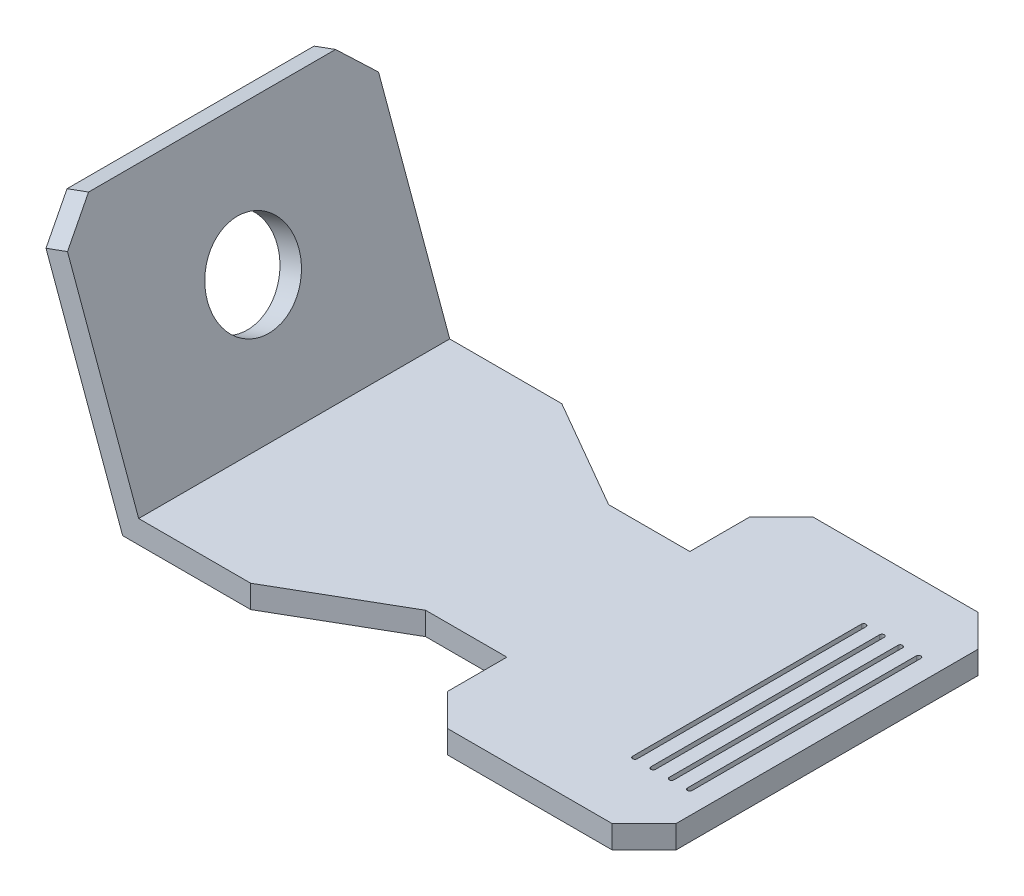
ISO-10303-21;
HEADER;
FILE_DESCRIPTION(('STEP AP214'),'2;1');
FILE_NAME('part.step','',(''),(''),'','','');
FILE_SCHEMA(('AUTOMOTIVE_DESIGN { 1 0 10303 214 1 1 1 1 }'));
ENDSEC;
DATA;
#1=APPLICATION_CONTEXT('core data for automotive mechanical design processes');
#2=APPLICATION_PROTOCOL_DEFINITION('international standard','automotive_design',2000,#1);
#3=PRODUCT_CONTEXT('',#1,'mechanical');
#4=PRODUCT('Part','Part','',(#3));
#5=PRODUCT_RELATED_PRODUCT_CATEGORY('part','',(#4));
#6=PRODUCT_DEFINITION_FORMATION('','',#4);
#7=PRODUCT_DEFINITION_CONTEXT('part definition',#1,'design');
#8=PRODUCT_DEFINITION('design','',#6,#7);
#9=PRODUCT_DEFINITION_SHAPE('','',#8);
#10=(LENGTH_UNIT() NAMED_UNIT(*) SI_UNIT(.MILLI.,.METRE.));
#11=(NAMED_UNIT(*) PLANE_ANGLE_UNIT() SI_UNIT($,.RADIAN.));
#12=(NAMED_UNIT(*) SI_UNIT($,.STERADIAN.) SOLID_ANGLE_UNIT());
#13=UNCERTAINTY_MEASURE_WITH_UNIT(LENGTH_MEASURE(1.E-05),#10,'distance_accuracy_value','');
#14=(GEOMETRIC_REPRESENTATION_CONTEXT(3) GLOBAL_UNCERTAINTY_ASSIGNED_CONTEXT((#13)) GLOBAL_UNIT_ASSIGNED_CONTEXT((#10,
#11,#12)) REPRESENTATION_CONTEXT('',''));
#15=CARTESIAN_POINT('',(0.,0.,0.));
#16=DIRECTION('',(0.,0.,1.));
#17=DIRECTION('',(1.,0.,0.));
#18=AXIS2_PLACEMENT_3D('',#15,#16,#17);
#19=CARTESIAN_POINT('',(-50.,5.,40.));
#20=DIRECTION('',(0.,-1.,0.));
#21=DIRECTION('',(0.,0.,-1.));
#22=AXIS2_PLACEMENT_3D('',#19,#20,#21);
#23=PLANE('',#22);
#24=DIRECTION('',(0.,0.,-1.));
#25=VECTOR('',#24,1.);
#26=CARTESIAN_POINT('',(-8.5,5.,25.));
#27=LINE('',#26,#25);
#28=CARTESIAN_POINT('',(-8.5,5.,25.));
#29=VERTEX_POINT('',#28);
#30=CARTESIAN_POINT('',(-8.5,5.,-25.));
#31=VERTEX_POINT('',#30);
#32=EDGE_CURVE('E280',#29,#31,#27,.T.);
#33=ORIENTED_EDGE('',*,*,#32,.F.);
#34=CARTESIAN_POINT('',(-9.,5.,25.));
#35=DIRECTION('',(0.,1.,0.));
#36=DIRECTION('',(0.,0.,1.));
#37=AXIS2_PLACEMENT_3D('',#34,#35,#36);
#38=CIRCLE('',#37,0.5);
#39=CARTESIAN_POINT('',(-9.5,5.,25.));
#40=VERTEX_POINT('',#39);
#41=EDGE_CURVE('E316',#40,#29,#38,.T.);
#42=ORIENTED_EDGE('',*,*,#41,.F.);
#43=DIRECTION('',(0.,0.,1.));
#44=VECTOR('',#43,1.);
#45=CARTESIAN_POINT('',(-9.5,5.,25.));
#46=LINE('',#45,#44);
#47=CARTESIAN_POINT('',(-9.5,5.,-25.));
#48=VERTEX_POINT('',#47);
#49=EDGE_CURVE('E302',#48,#40,#46,.T.);
#50=ORIENTED_EDGE('',*,*,#49,.F.);
#51=CARTESIAN_POINT('',(-9.,5.,-25.));
#52=DIRECTION('',(0.,1.,0.));
#53=DIRECTION('',(0.,0.,1.));
#54=AXIS2_PLACEMENT_3D('',#51,#52,#53);
#55=CIRCLE('',#54,0.5);
#56=EDGE_CURVE('E295',#31,#48,#55,.T.);
#57=ORIENTED_EDGE('',*,*,#56,.F.);
#58=EDGE_LOOP('',(#33,#42,#50,#57));
#59=FACE_BOUND('',#58,.T.);
#60=DIRECTION('',(0.,0.,-1.));
#61=VECTOR('',#60,1.);
#62=CARTESIAN_POINT('',(-4.5,5.,25.));
#63=LINE('',#62,#61);
#64=CARTESIAN_POINT('',(-4.5,5.,25.));
#65=VERTEX_POINT('',#64);
#66=CARTESIAN_POINT('',(-4.5,5.,-25.));
#67=VERTEX_POINT('',#66);
#68=EDGE_CURVE('E337',#65,#67,#63,.T.);
#69=ORIENTED_EDGE('',*,*,#68,.F.);
#70=CARTESIAN_POINT('',(-5.,5.,25.));
#71=DIRECTION('',(0.,1.,0.));
#72=DIRECTION('',(0.,0.,1.));
#73=AXIS2_PLACEMENT_3D('',#70,#71,#72);
#74=CIRCLE('',#73,0.5);
#75=CARTESIAN_POINT('',(-5.5,5.,25.));
#76=VERTEX_POINT('',#75);
#77=EDGE_CURVE('E321',#76,#65,#74,.T.);
#78=ORIENTED_EDGE('',*,*,#77,.F.);
#79=DIRECTION('',(0.,0.,1.));
#80=VECTOR('',#79,1.);
#81=CARTESIAN_POINT('',(-5.5,5.,25.));
#82=LINE('',#81,#80);
#83=CARTESIAN_POINT('',(-5.5,5.,-25.));
#84=VERTEX_POINT('',#83);
#85=EDGE_CURVE('E326',#84,#76,#82,.T.);
#86=ORIENTED_EDGE('',*,*,#85,.F.);
#87=CARTESIAN_POINT('',(-5.,5.,-25.));
#88=DIRECTION('',(0.,1.,0.));
#89=DIRECTION('',(0.,0.,1.));
#90=AXIS2_PLACEMENT_3D('',#87,#88,#89);
#91=CIRCLE('',#90,0.5);
#92=EDGE_CURVE('E340',#67,#84,#91,.T.);
#93=ORIENTED_EDGE('',*,*,#92,.F.);
#94=EDGE_LOOP('',(#69,#78,#86,#93));
#95=FACE_BOUND('',#94,.T.);
#96=DIRECTION('',(0.,0.,-1.));
#97=VECTOR('',#96,1.);
#98=CARTESIAN_POINT('',(0.,5.,40.));
#99=LINE('',#98,#97);
#100=CARTESIAN_POINT('',(0.,5.,33.));
#101=VERTEX_POINT('',#100);
#102=CARTESIAN_POINT('',(0.,5.,-33.));
#103=VERTEX_POINT('',#102);
#104=EDGE_CURVE('E370',#101,#103,#99,.T.);
#105=ORIENTED_EDGE('',*,*,#104,.T.);
#106=DIRECTION('',(0.707106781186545,0.,0.70710678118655));
#107=VECTOR('',#106,1.);
#108=CARTESIAN_POINT('',(-6.99999999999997,5.,-40.));
#109=LINE('',#108,#107);
#110=CARTESIAN_POINT('',(-6.99999999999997,5.,-40.));
#111=VERTEX_POINT('',#110);
#112=EDGE_CURVE('E544',#103,#111,#109,.F.);
#113=ORIENTED_EDGE('',*,*,#112,.T.);
#114=DIRECTION('',(-1.,0.,0.));
#115=VECTOR('',#114,1.);
#116=CARTESIAN_POINT('',(0.,5.,-40.));
#117=LINE('',#116,#115);
#118=CARTESIAN_POINT('',(-43.,5.,-40.));
#119=VERTEX_POINT('',#118);
#120=EDGE_CURVE('E374',#111,#119,#117,.T.);
#121=ORIENTED_EDGE('',*,*,#120,.T.);
#122=DIRECTION('',(0.707106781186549,0.,-0.707106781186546));
#123=VECTOR('',#122,1.);
#124=CARTESIAN_POINT('',(-50.,5.,-33.));
#125=LINE('',#124,#123);
#126=CARTESIAN_POINT('',(-50.,5.,-33.));
#127=VERTEX_POINT('',#126);
#128=EDGE_CURVE('E540',#119,#127,#125,.F.);
#129=ORIENTED_EDGE('',*,*,#128,.T.);
#130=DIRECTION('',(0.,0.,1.));
#131=VECTOR('',#130,1.);
#132=CARTESIAN_POINT('',(-50.,5.,-40.));
#133=LINE('',#132,#131);
#134=CARTESIAN_POINT('',(-50.,5.,-20.));
#135=VERTEX_POINT('',#134);
#136=EDGE_CURVE('E377',#127,#135,#133,.T.);
#137=ORIENTED_EDGE('',*,*,#136,.T.);
#138=DIRECTION('',(-1.,0.,0.));
#139=VECTOR('',#138,1.);
#140=CARTESIAN_POINT('',(-50.,5.,-20.));
#141=LINE('',#140,#139);
#142=CARTESIAN_POINT('',(-67.7512886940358,5.,-20.));
#143=VERTEX_POINT('',#142);
#144=EDGE_CURVE('E379',#135,#143,#141,.T.);
#145=ORIENTED_EDGE('',*,*,#144,.T.);
#146=DIRECTION('',(-0.866025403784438,0.,-0.500000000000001));
#147=VECTOR('',#146,1.);
#148=CARTESIAN_POINT('',(-67.7512886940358,5.,-20.));
#149=LINE('',#148,#147);
#150=CARTESIAN_POINT('',(-92.,5.,-34.));
#151=VERTEX_POINT('',#150);
#152=EDGE_CURVE('E382',#143,#151,#149,.T.);
#153=ORIENTED_EDGE('',*,*,#152,.T.);
#154=DIRECTION('',(-1.,0.,0.));
#155=VECTOR('',#154,1.);
#156=CARTESIAN_POINT('',(-92.,5.,-34.));
#157=LINE('',#156,#155);
#158=CARTESIAN_POINT('',(-116.498962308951,5.,-34.));
#159=VERTEX_POINT('',#158);
#160=EDGE_CURVE('E384',#151,#159,#157,.T.);
#161=ORIENTED_EDGE('',*,*,#160,.T.);
#162=DIRECTION('',(0.,0.,-1.));
#163=VECTOR('',#162,1.);
#164=CARTESIAN_POINT('',(-116.498962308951,5.,40.));
#165=LINE('',#164,#163);
#166=CARTESIAN_POINT('',(-116.498962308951,5.,34.));
#167=VERTEX_POINT('',#166);
#168=EDGE_CURVE('E451',#167,#159,#165,.T.);
#169=ORIENTED_EDGE('',*,*,#168,.F.);
#170=DIRECTION('',(1.,0.,0.));
#171=VECTOR('',#170,1.);
#172=CARTESIAN_POINT('',(-92.,5.,34.));
#173=LINE('',#172,#171);
#174=CARTESIAN_POINT('',(-92.,5.,34.));
#175=VERTEX_POINT('',#174);
#176=EDGE_CURVE('E387',#167,#175,#173,.T.);
#177=ORIENTED_EDGE('',*,*,#176,.T.);
#178=DIRECTION('',(0.866025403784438,0.,-0.500000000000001));
#179=VECTOR('',#178,1.);
#180=CARTESIAN_POINT('',(-67.7512886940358,5.,20.));
#181=LINE('',#180,#179);
#182=CARTESIAN_POINT('',(-67.7512886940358,5.,20.));
#183=VERTEX_POINT('',#182);
#184=EDGE_CURVE('E389',#175,#183,#181,.T.);
#185=ORIENTED_EDGE('',*,*,#184,.T.);
#186=DIRECTION('',(1.,0.,0.));
#187=VECTOR('',#186,1.);
#188=CARTESIAN_POINT('',(-50.,5.,20.));
#189=LINE('',#188,#187);
#190=CARTESIAN_POINT('',(-50.,5.,20.));
#191=VERTEX_POINT('',#190);
#192=EDGE_CURVE('E391',#183,#191,#189,.T.);
#193=ORIENTED_EDGE('',*,*,#192,.T.);
#194=DIRECTION('',(0.,0.,1.));
#195=VECTOR('',#194,1.);
#196=CARTESIAN_POINT('',(-50.,5.,40.));
#197=LINE('',#196,#195);
#198=CARTESIAN_POINT('',(-50.,5.,33.));
#199=VERTEX_POINT('',#198);
#200=EDGE_CURVE('E394',#191,#199,#197,.T.);
#201=ORIENTED_EDGE('',*,*,#200,.T.);
#202=DIRECTION('',(-0.707106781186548,0.,-0.707106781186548));
#203=VECTOR('',#202,1.);
#204=CARTESIAN_POINT('',(-43.,5.,40.));
#205=LINE('',#204,#203);
#206=CARTESIAN_POINT('',(-43.,5.,40.));
#207=VERTEX_POINT('',#206);
#208=EDGE_CURVE('E538',#199,#207,#205,.F.);
#209=ORIENTED_EDGE('',*,*,#208,.T.);
#210=DIRECTION('',(1.,0.,0.));
#211=VECTOR('',#210,1.);
#212=CARTESIAN_POINT('',(0.,5.,40.));
#213=LINE('',#212,#211);
#214=CARTESIAN_POINT('',(-7.00000000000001,5.,40.));
#215=VERTEX_POINT('',#214);
#216=EDGE_CURVE('E367',#207,#215,#213,.T.);
#217=ORIENTED_EDGE('',*,*,#216,.T.);
#218=DIRECTION('',(-0.707106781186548,0.,0.707106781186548));
#219=VECTOR('',#218,1.);
#220=CARTESIAN_POINT('',(0.,5.,33.));
#221=LINE('',#220,#219);
#222=EDGE_CURVE('E542',#215,#101,#221,.F.);
#223=ORIENTED_EDGE('',*,*,#222,.T.);
#224=EDGE_LOOP('',(#105,#113,#121,#129,#137,#145,#153,#161,#169,#177,#185,#193,#201,#209,#217,#223));
#225=FACE_BOUND('',#224,.T.);
#226=CARTESIAN_POINT('',(-13.,5.,25.));
#227=DIRECTION('',(0.,1.,0.));
#228=DIRECTION('',(0.,0.,1.));
#229=AXIS2_PLACEMENT_3D('',#226,#227,#228);
#230=CIRCLE('',#229,0.5);
#231=CARTESIAN_POINT('',(-13.5,5.,25.));
#232=VERTEX_POINT('',#231);
#233=CARTESIAN_POINT('',(-12.5,5.,25.));
#234=VERTEX_POINT('',#233);
#235=EDGE_CURVE('E454',#232,#234,#230,.T.);
#236=ORIENTED_EDGE('',*,*,#235,.F.);
#237=DIRECTION('',(0.,0.,1.));
#238=VECTOR('',#237,1.);
#239=CARTESIAN_POINT('',(-13.5,5.,25.));
#240=LINE('',#239,#238);
#241=CARTESIAN_POINT('',(-13.5,5.,-25.));
#242=VERTEX_POINT('',#241);
#243=EDGE_CURVE('E456',#242,#232,#240,.T.);
#244=ORIENTED_EDGE('',*,*,#243,.F.);
#245=CARTESIAN_POINT('',(-13.,5.,-25.));
#246=DIRECTION('',(0.,1.,0.));
#247=DIRECTION('',(0.,0.,1.));
#248=AXIS2_PLACEMENT_3D('',#245,#246,#247);
#249=CIRCLE('',#248,0.5);
#250=CARTESIAN_POINT('',(-12.5,5.,-25.));
#251=VERTEX_POINT('',#250);
#252=EDGE_CURVE('E459',#251,#242,#249,.T.);
#253=ORIENTED_EDGE('',*,*,#252,.F.);
#254=DIRECTION('',(0.,0.,-1.));
#255=VECTOR('',#254,1.);
#256=CARTESIAN_POINT('',(-12.5,5.,25.));
#257=LINE('',#256,#255);
#258=EDGE_CURVE('E462',#234,#251,#257,.T.);
#259=ORIENTED_EDGE('',*,*,#258,.F.);
#260=EDGE_LOOP('',(#236,#244,#253,#259));
#261=FACE_BOUND('',#260,.T.);
#262=CARTESIAN_POINT('',(-17.,5.,25.));
#263=DIRECTION('',(0.,1.,0.));
#264=DIRECTION('',(0.,0.,1.));
#265=AXIS2_PLACEMENT_3D('',#262,#263,#264);
#266=CIRCLE('',#265,0.5);
#267=CARTESIAN_POINT('',(-17.5,5.,25.));
#268=VERTEX_POINT('',#267);
#269=CARTESIAN_POINT('',(-16.5,5.,25.));
#270=VERTEX_POINT('',#269);
#271=EDGE_CURVE('E486',#268,#270,#266,.T.);
#272=ORIENTED_EDGE('',*,*,#271,.F.);
#273=DIRECTION('',(0.,0.,1.));
#274=VECTOR('',#273,1.);
#275=CARTESIAN_POINT('',(-17.5,5.,25.));
#276=LINE('',#275,#274);
#277=CARTESIAN_POINT('',(-17.5,5.,-25.));
#278=VERTEX_POINT('',#277);
#279=EDGE_CURVE('E488',#278,#268,#276,.T.);
#280=ORIENTED_EDGE('',*,*,#279,.F.);
#281=CARTESIAN_POINT('',(-17.,5.,-25.));
#282=DIRECTION('',(0.,1.,0.));
#283=DIRECTION('',(0.,0.,1.));
#284=AXIS2_PLACEMENT_3D('',#281,#282,#283);
#285=CIRCLE('',#284,0.5);
#286=CARTESIAN_POINT('',(-16.5,5.,-25.));
#287=VERTEX_POINT('',#286);
#288=EDGE_CURVE('E492',#287,#278,#285,.T.);
#289=ORIENTED_EDGE('',*,*,#288,.F.);
#290=DIRECTION('',(0.,0.,-1.));
#291=VECTOR('',#290,1.);
#292=CARTESIAN_POINT('',(-16.5,5.,25.));
#293=LINE('',#292,#291);
#294=EDGE_CURVE('E495',#270,#287,#293,.T.);
#295=ORIENTED_EDGE('',*,*,#294,.F.);
#296=EDGE_LOOP('',(#272,#280,#289,#295));
#297=FACE_BOUND('',#296,.T.);
#298=ADVANCED_FACE('F40',(#59,#95,#225,#261,#297),#23,.F.);
#299=CARTESIAN_POINT('',(0.,5.,40.));
#300=DIRECTION('',(0.,0.,-1.));
#301=DIRECTION('',(-1.,0.,0.));
#302=AXIS2_PLACEMENT_3D('',#299,#300,#301);
#303=PLANE('',#302);
#304=DIRECTION('',(1.,0.,0.));
#305=VECTOR('',#304,1.);
#306=CARTESIAN_POINT('',(0.,0.,40.));
#307=LINE('',#306,#305);
#308=CARTESIAN_POINT('',(-43.,0.,40.));
#309=VERTEX_POINT('',#308);
#310=CARTESIAN_POINT('',(-7.00000000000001,0.,40.));
#311=VERTEX_POINT('',#310);
#312=EDGE_CURVE('E361',#309,#311,#307,.T.);
#313=ORIENTED_EDGE('',*,*,#312,.T.);
#314=DIRECTION('',(0.,1.,0.));
#315=VECTOR('',#314,1.);
#316=CARTESIAN_POINT('',(-7.00000000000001,5.,40.));
#317=LINE('',#316,#315);
#318=EDGE_CURVE('E549',#311,#215,#317,.T.);
#319=ORIENTED_EDGE('',*,*,#318,.T.);
#320=ORIENTED_EDGE('',*,*,#216,.F.);
#321=DIRECTION('',(0.,-1.,0.));
#322=VECTOR('',#321,1.);
#323=CARTESIAN_POINT('',(-43.,5.,40.));
#324=LINE('',#323,#322);
#325=EDGE_CURVE('E546',#207,#309,#324,.T.);
#326=ORIENTED_EDGE('',*,*,#325,.T.);
#327=EDGE_LOOP('',(#313,#319,#320,#326));
#328=FACE_BOUND('',#327,.T.);
#329=ADVANCED_FACE('F625',(#328),#303,.F.);
#330=CARTESIAN_POINT('',(0.,5.,40.));
#331=DIRECTION('',(-1.,0.,0.));
#332=DIRECTION('',(0.,0.,1.));
#333=AXIS2_PLACEMENT_3D('',#330,#331,#332);
#334=PLANE('',#333);
#335=DIRECTION('',(0.,0.,-1.));
#336=VECTOR('',#335,1.);
#337=CARTESIAN_POINT('',(0.,0.,40.));
#338=LINE('',#337,#336);
#339=CARTESIAN_POINT('',(0.,0.,33.));
#340=VERTEX_POINT('',#339);
#341=CARTESIAN_POINT('',(0.,0.,-33.));
#342=VERTEX_POINT('',#341);
#343=EDGE_CURVE('E401',#340,#342,#338,.T.);
#344=ORIENTED_EDGE('',*,*,#343,.T.);
#345=DIRECTION('',(0.,1.,0.));
#346=VECTOR('',#345,1.);
#347=CARTESIAN_POINT('',(0.,5.,-33.));
#348=LINE('',#347,#346);
#349=EDGE_CURVE('E536',#342,#103,#348,.T.);
#350=ORIENTED_EDGE('',*,*,#349,.T.);
#351=ORIENTED_EDGE('',*,*,#104,.F.);
#352=DIRECTION('',(0.,-1.,0.));
#353=VECTOR('',#352,1.);
#354=CARTESIAN_POINT('',(0.,5.,33.));
#355=LINE('',#354,#353);
#356=EDGE_CURVE('E533',#101,#340,#355,.T.);
#357=ORIENTED_EDGE('',*,*,#356,.T.);
#358=EDGE_LOOP('',(#344,#350,#351,#357));
#359=FACE_BOUND('',#358,.T.);
#360=ADVANCED_FACE('F634',(#359),#334,.F.);
#361=CARTESIAN_POINT('',(0.,5.,-40.));
#362=DIRECTION('',(0.,0.,1.));
#363=DIRECTION('',(1.,0.,0.));
#364=AXIS2_PLACEMENT_3D('',#361,#362,#363);
#365=PLANE('',#364);
#366=ORIENTED_EDGE('',*,*,#120,.F.);
#367=DIRECTION('',(0.,-1.,0.));
#368=VECTOR('',#367,1.);
#369=CARTESIAN_POINT('',(-6.99999999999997,5.,-40.));
#370=LINE('',#369,#368);
#371=CARTESIAN_POINT('',(-6.99999999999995,0.,-40.));
#372=VERTEX_POINT('',#371);
#373=EDGE_CURVE('E522',#111,#372,#370,.T.);
#374=ORIENTED_EDGE('',*,*,#373,.T.);
#375=DIRECTION('',(-1.,0.,0.));
#376=VECTOR('',#375,1.);
#377=CARTESIAN_POINT('',(0.,0.,-40.));
#378=LINE('',#377,#376);
#379=CARTESIAN_POINT('',(-43.,0.,-40.));
#380=VERTEX_POINT('',#379);
#381=EDGE_CURVE('E404',#372,#380,#378,.T.);
#382=ORIENTED_EDGE('',*,*,#381,.T.);
#383=DIRECTION('',(0.,1.,0.));
#384=VECTOR('',#383,1.);
#385=CARTESIAN_POINT('',(-43.,5.,-40.));
#386=LINE('',#385,#384);
#387=EDGE_CURVE('E520',#380,#119,#386,.T.);
#388=ORIENTED_EDGE('',*,*,#387,.T.);
#389=EDGE_LOOP('',(#366,#374,#382,#388));
#390=FACE_BOUND('',#389,.T.);
#391=ADVANCED_FACE('F642',(#390),#365,.F.);
#392=CARTESIAN_POINT('',(-50.,5.,-40.));
#393=DIRECTION('',(1.,0.,0.));
#394=DIRECTION('',(0.,0.,-1.));
#395=AXIS2_PLACEMENT_3D('',#392,#393,#394);
#396=PLANE('',#395);
#397=ORIENTED_EDGE('',*,*,#136,.F.);
#398=DIRECTION('',(0.,-1.,0.));
#399=VECTOR('',#398,1.);
#400=CARTESIAN_POINT('',(-50.,5.,-33.));
#401=LINE('',#400,#399);
#402=CARTESIAN_POINT('',(-50.,0.,-33.));
#403=VERTEX_POINT('',#402);
#404=EDGE_CURVE('E551',#127,#403,#401,.T.);
#405=ORIENTED_EDGE('',*,*,#404,.T.);
#406=DIRECTION('',(0.,0.,1.));
#407=VECTOR('',#406,1.);
#408=CARTESIAN_POINT('',(-50.,0.,-40.));
#409=LINE('',#408,#407);
#410=CARTESIAN_POINT('',(-50.,0.,-20.));
#411=VERTEX_POINT('',#410);
#412=EDGE_CURVE('E407',#403,#411,#409,.T.);
#413=ORIENTED_EDGE('',*,*,#412,.T.);
#414=DIRECTION('',(0.,-1.,0.));
#415=VECTOR('',#414,1.);
#416=CARTESIAN_POINT('',(-50.,5.,-20.));
#417=LINE('',#416,#415);
#418=EDGE_CURVE('E447',#135,#411,#417,.T.);
#419=ORIENTED_EDGE('',*,*,#418,.F.);
#420=EDGE_LOOP('',(#397,#405,#413,#419));
#421=FACE_BOUND('',#420,.T.);
#422=ADVANCED_FACE('F651',(#421),#396,.F.);
#423=CARTESIAN_POINT('',(-50.,5.,-20.));
#424=DIRECTION('',(0.,0.,1.));
#425=DIRECTION('',(1.,0.,0.));
#426=AXIS2_PLACEMENT_3D('',#423,#424,#425);
#427=PLANE('',#426);
#428=DIRECTION('',(-1.,0.,0.));
#429=VECTOR('',#428,1.);
#430=CARTESIAN_POINT('',(-50.,0.,-20.));
#431=LINE('',#430,#429);
#432=CARTESIAN_POINT('',(-67.7512886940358,0.,-20.));
#433=VERTEX_POINT('',#432);
#434=EDGE_CURVE('E410',#411,#433,#431,.T.);
#435=ORIENTED_EDGE('',*,*,#434,.T.);
#436=DIRECTION('',(0.,-1.,0.));
#437=VECTOR('',#436,1.);
#438=CARTESIAN_POINT('',(-67.7512886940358,5.,-20.));
#439=LINE('',#438,#437);
#440=EDGE_CURVE('E443',#143,#433,#439,.T.);
#441=ORIENTED_EDGE('',*,*,#440,.F.);
#442=ORIENTED_EDGE('',*,*,#144,.F.);
#443=ORIENTED_EDGE('',*,*,#418,.T.);
#444=EDGE_LOOP('',(#435,#441,#442,#443));
#445=FACE_BOUND('',#444,.T.);
#446=ADVANCED_FACE('F656',(#445),#427,.F.);
#447=CARTESIAN_POINT('',(-67.7512886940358,5.,-20.));
#448=DIRECTION('',(-0.500000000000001,0.,0.866025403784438));
#449=DIRECTION('',(0.866025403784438,0.,0.500000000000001));
#450=AXIS2_PLACEMENT_3D('',#447,#448,#449);
#451=PLANE('',#450);
#452=DIRECTION('',(-0.866025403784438,0.,-0.500000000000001));
#453=VECTOR('',#452,1.);
#454=CARTESIAN_POINT('',(-67.7512886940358,0.,-20.));
#455=LINE('',#454,#453);
#456=CARTESIAN_POINT('',(-92.,0.,-34.));
#457=VERTEX_POINT('',#456);
#458=EDGE_CURVE('E413',#433,#457,#455,.T.);
#459=ORIENTED_EDGE('',*,*,#458,.T.);
#460=DIRECTION('',(0.,-1.,0.));
#461=VECTOR('',#460,1.);
#462=CARTESIAN_POINT('',(-92.,5.,-34.));
#463=LINE('',#462,#461);
#464=EDGE_CURVE('E440',#151,#457,#463,.T.);
#465=ORIENTED_EDGE('',*,*,#464,.F.);
#466=ORIENTED_EDGE('',*,*,#152,.F.);
#467=ORIENTED_EDGE('',*,*,#440,.T.);
#468=EDGE_LOOP('',(#459,#465,#466,#467));
#469=FACE_BOUND('',#468,.T.);
#470=ADVANCED_FACE('F657',(#469),#451,.F.);
#471=CARTESIAN_POINT('',(-92.,5.,-34.));
#472=DIRECTION('',(0.,0.,1.));
#473=DIRECTION('',(1.,0.,0.));
#474=AXIS2_PLACEMENT_3D('',#471,#472,#473);
#475=PLANE('',#474);
#476=DIRECTION('',(-0.342020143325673,0.939692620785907,0.));
#477=VECTOR('',#476,1.);
#478=CARTESIAN_POINT('',(-120.,0.,-34.));
#479=LINE('',#478,#477);
#480=CARTESIAN_POINT('',(-120.,0.,-34.));
#481=VERTEX_POINT('',#480);
#482=CARTESIAN_POINT('',(-136.758987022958,46.0449384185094,-34.));
#483=VERTEX_POINT('',#482);
#484=EDGE_CURVE('E347',#481,#483,#479,.T.);
#485=ORIENTED_EDGE('',*,*,#484,.T.);
#486=DIRECTION('',(0.939692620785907,0.342020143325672,0.));
#487=VECTOR('',#486,1.);
#488=CARTESIAN_POINT('',(-110.427395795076,55.6288538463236,-34.));
#489=LINE('',#488,#487);
#490=CARTESIAN_POINT('',(-132.060523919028,47.7550391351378,-34.));
#491=VERTEX_POINT('',#490);
#492=EDGE_CURVE('E556',#483,#491,#489,.T.);
#493=ORIENTED_EDGE('',*,*,#492,.T.);
#494=DIRECTION('',(0.342020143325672,-0.939692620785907,0.));
#495=VECTOR('',#494,1.);
#496=CARTESIAN_POINT('',(-115.30153689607,1.71010071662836,-34.));
#497=LINE('',#496,#495);
#498=EDGE_CURVE('E356',#491,#159,#497,.T.);
#499=ORIENTED_EDGE('',*,*,#498,.T.);
#500=ORIENTED_EDGE('',*,*,#160,.F.);
#501=ORIENTED_EDGE('',*,*,#464,.T.);
#502=DIRECTION('',(-1.,0.,0.));
#503=VECTOR('',#502,1.);
#504=CARTESIAN_POINT('',(-92.,0.,-34.));
#505=LINE('',#504,#503);
#506=EDGE_CURVE('E416',#457,#481,#505,.T.);
#507=ORIENTED_EDGE('',*,*,#506,.T.);
#508=EDGE_LOOP('',(#485,#493,#499,#500,#501,#507));
#509=FACE_BOUND('',#508,.T.);
#510=ADVANCED_FACE('F575',(#509),#475,.F.);
#511=CARTESIAN_POINT('',(-92.,5.,34.));
#512=DIRECTION('',(0.,0.,-1.));
#513=DIRECTION('',(-1.,0.,0.));
#514=AXIS2_PLACEMENT_3D('',#511,#512,#513);
#515=PLANE('',#514);
#516=DIRECTION('',(0.342020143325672,-0.939692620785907,0.));
#517=VECTOR('',#516,1.);
#518=CARTESIAN_POINT('',(-115.30153689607,1.71010071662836,34.));
#519=LINE('',#518,#517);
#520=CARTESIAN_POINT('',(-132.060523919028,47.7550391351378,34.));
#521=VERTEX_POINT('',#520);
#522=EDGE_CURVE('E359',#521,#167,#519,.T.);
#523=ORIENTED_EDGE('',*,*,#522,.F.);
#524=DIRECTION('',(-0.939692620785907,-0.342020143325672,0.));
#525=VECTOR('',#524,1.);
#526=CARTESIAN_POINT('',(-110.427395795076,55.6288538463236,34.));
#527=LINE('',#526,#525);
#528=CARTESIAN_POINT('',(-136.758987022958,46.0449384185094,34.));
#529=VERTEX_POINT('',#528);
#530=EDGE_CURVE('E11',#521,#529,#527,.T.);
#531=ORIENTED_EDGE('',*,*,#530,.T.);
#532=DIRECTION('',(-0.342020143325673,0.939692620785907,0.));
#533=VECTOR('',#532,1.);
#534=CARTESIAN_POINT('',(-120.,0.,34.));
#535=LINE('',#534,#533);
#536=CARTESIAN_POINT('',(-120.,0.,34.));
#537=VERTEX_POINT('',#536);
#538=EDGE_CURVE('E362',#537,#529,#535,.T.);
#539=ORIENTED_EDGE('',*,*,#538,.F.);
#540=DIRECTION('',(1.,0.,0.));
#541=VECTOR('',#540,1.);
#542=CARTESIAN_POINT('',(-92.,0.,34.));
#543=LINE('',#542,#541);
#544=CARTESIAN_POINT('',(-92.,0.,34.));
#545=VERTEX_POINT('',#544);
#546=EDGE_CURVE('E421',#537,#545,#543,.T.);
#547=ORIENTED_EDGE('',*,*,#546,.T.);
#548=DIRECTION('',(0.,-1.,0.));
#549=VECTOR('',#548,1.);
#550=CARTESIAN_POINT('',(-92.,5.,34.));
#551=LINE('',#550,#549);
#552=EDGE_CURVE('E437',#175,#545,#551,.T.);
#553=ORIENTED_EDGE('',*,*,#552,.F.);
#554=ORIENTED_EDGE('',*,*,#176,.F.);
#555=EDGE_LOOP('',(#523,#531,#539,#547,#553,#554));
#556=FACE_BOUND('',#555,.T.);
#557=ADVANCED_FACE('F589',(#556),#515,.F.);
#558=CARTESIAN_POINT('',(-67.7512886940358,5.,20.));
#559=DIRECTION('',(-0.500000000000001,0.,-0.866025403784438));
#560=DIRECTION('',(-0.866025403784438,0.,0.500000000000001));
#561=AXIS2_PLACEMENT_3D('',#558,#559,#560);
#562=PLANE('',#561);
#563=DIRECTION('',(0.866025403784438,0.,-0.500000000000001));
#564=VECTOR('',#563,1.);
#565=CARTESIAN_POINT('',(-67.7512886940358,0.,20.));
#566=LINE('',#565,#564);
#567=CARTESIAN_POINT('',(-67.7512886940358,0.,20.));
#568=VERTEX_POINT('',#567);
#569=EDGE_CURVE('E423',#545,#568,#566,.T.);
#570=ORIENTED_EDGE('',*,*,#569,.T.);
#571=DIRECTION('',(0.,-1.,0.));
#572=VECTOR('',#571,1.);
#573=CARTESIAN_POINT('',(-67.7512886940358,5.,20.));
#574=LINE('',#573,#572);
#575=EDGE_CURVE('E434',#183,#568,#574,.T.);
#576=ORIENTED_EDGE('',*,*,#575,.F.);
#577=ORIENTED_EDGE('',*,*,#184,.F.);
#578=ORIENTED_EDGE('',*,*,#552,.T.);
#579=EDGE_LOOP('',(#570,#576,#577,#578));
#580=FACE_BOUND('',#579,.T.);
#581=ADVANCED_FACE('F607',(#580),#562,.F.);
#582=CARTESIAN_POINT('',(-50.,5.,20.));
#583=DIRECTION('',(0.,0.,-1.));
#584=DIRECTION('',(-1.,0.,0.));
#585=AXIS2_PLACEMENT_3D('',#582,#583,#584);
#586=PLANE('',#585);
#587=DIRECTION('',(1.,0.,0.));
#588=VECTOR('',#587,1.);
#589=CARTESIAN_POINT('',(-50.,0.,20.));
#590=LINE('',#589,#588);
#591=CARTESIAN_POINT('',(-50.,0.,20.));
#592=VERTEX_POINT('',#591);
#593=EDGE_CURVE('E425',#568,#592,#590,.T.);
#594=ORIENTED_EDGE('',*,*,#593,.T.);
#595=DIRECTION('',(0.,-1.,0.));
#596=VECTOR('',#595,1.);
#597=CARTESIAN_POINT('',(-50.,5.,20.));
#598=LINE('',#597,#596);
#599=EDGE_CURVE('E398',#191,#592,#598,.T.);
#600=ORIENTED_EDGE('',*,*,#599,.F.);
#601=ORIENTED_EDGE('',*,*,#192,.F.);
#602=ORIENTED_EDGE('',*,*,#575,.T.);
#603=EDGE_LOOP('',(#594,#600,#601,#602));
#604=FACE_BOUND('',#603,.T.);
#605=ADVANCED_FACE('F612',(#604),#586,.F.);
#606=CARTESIAN_POINT('',(-50.,5.,40.));
#607=DIRECTION('',(1.,0.,0.));
#608=DIRECTION('',(0.,0.,-1.));
#609=AXIS2_PLACEMENT_3D('',#606,#607,#608);
#610=PLANE('',#609);
#611=DIRECTION('',(0.,0.,1.));
#612=VECTOR('',#611,1.);
#613=CARTESIAN_POINT('',(-50.,0.,40.));
#614=LINE('',#613,#612);
#615=CARTESIAN_POINT('',(-50.,0.,33.));
#616=VERTEX_POINT('',#615);
#617=EDGE_CURVE('E371',#592,#616,#614,.T.);
#618=ORIENTED_EDGE('',*,*,#617,.T.);
#619=DIRECTION('',(0.,1.,0.));
#620=VECTOR('',#619,1.);
#621=CARTESIAN_POINT('',(-50.,5.,33.));
#622=LINE('',#621,#620);
#623=EDGE_CURVE('E554',#616,#199,#622,.T.);
#624=ORIENTED_EDGE('',*,*,#623,.T.);
#625=ORIENTED_EDGE('',*,*,#200,.F.);
#626=ORIENTED_EDGE('',*,*,#599,.T.);
#627=EDGE_LOOP('',(#618,#624,#625,#626));
#628=FACE_BOUND('',#627,.T.);
#629=ADVANCED_FACE('F616',(#628),#610,.F.);
#630=CARTESIAN_POINT('',(-50.,0.,40.));
#631=DIRECTION('',(0.,-1.,0.));
#632=DIRECTION('',(0.,0.,-1.));
#633=AXIS2_PLACEMENT_3D('',#630,#631,#632);
#634=PLANE('',#633);
#635=CARTESIAN_POINT('',(-9.,0.,25.));
#636=DIRECTION('',(0.,1.,0.));
#637=DIRECTION('',(0.,0.,1.));
#638=AXIS2_PLACEMENT_3D('',#635,#636,#637);
#639=CIRCLE('',#638,0.5);
#640=CARTESIAN_POINT('',(-9.5,0.,25.));
#641=VERTEX_POINT('',#640);
#642=CARTESIAN_POINT('',(-8.5,0.,25.));
#643=VERTEX_POINT('',#642);
#644=EDGE_CURVE('E318',#641,#643,#639,.T.);
#645=ORIENTED_EDGE('',*,*,#644,.T.);
#646=DIRECTION('',(0.,0.,-1.));
#647=VECTOR('',#646,1.);
#648=CARTESIAN_POINT('',(-8.5,0.,25.));
#649=LINE('',#648,#647);
#650=CARTESIAN_POINT('',(-8.5,0.,-25.));
#651=VERTEX_POINT('',#650);
#652=EDGE_CURVE('E290',#643,#651,#649,.T.);
#653=ORIENTED_EDGE('',*,*,#652,.T.);
#654=CARTESIAN_POINT('',(-9.,0.,-25.));
#655=DIRECTION('',(0.,1.,0.));
#656=DIRECTION('',(0.,0.,1.));
#657=AXIS2_PLACEMENT_3D('',#654,#655,#656);
#658=CIRCLE('',#657,0.5);
#659=CARTESIAN_POINT('',(-9.5,0.,-25.));
#660=VERTEX_POINT('',#659);
#661=EDGE_CURVE('E298',#651,#660,#658,.T.);
#662=ORIENTED_EDGE('',*,*,#661,.T.);
#663=DIRECTION('',(0.,0.,1.));
#664=VECTOR('',#663,1.);
#665=CARTESIAN_POINT('',(-9.5,0.,25.));
#666=LINE('',#665,#664);
#667=EDGE_CURVE('E313',#660,#641,#666,.T.);
#668=ORIENTED_EDGE('',*,*,#667,.T.);
#669=EDGE_LOOP('',(#645,#653,#662,#668));
#670=FACE_BOUND('',#669,.T.);
#671=CARTESIAN_POINT('',(-5.,0.,25.));
#672=DIRECTION('',(0.,1.,0.));
#673=DIRECTION('',(0.,0.,1.));
#674=AXIS2_PLACEMENT_3D('',#671,#672,#673);
#675=CIRCLE('',#674,0.5);
#676=CARTESIAN_POINT('',(-5.5,0.,25.));
#677=VERTEX_POINT('',#676);
#678=CARTESIAN_POINT('',(-4.5,0.,25.));
#679=VERTEX_POINT('',#678);
#680=EDGE_CURVE('E322',#677,#679,#675,.T.);
#681=ORIENTED_EDGE('',*,*,#680,.T.);
#682=DIRECTION('',(0.,0.,-1.));
#683=VECTOR('',#682,1.);
#684=CARTESIAN_POINT('',(-4.5,0.,25.));
#685=LINE('',#684,#683);
#686=CARTESIAN_POINT('',(-4.5,0.,-25.));
#687=VERTEX_POINT('',#686);
#688=EDGE_CURVE('E325',#679,#687,#685,.T.);
#689=ORIENTED_EDGE('',*,*,#688,.T.);
#690=CARTESIAN_POINT('',(-5.,0.,-25.));
#691=DIRECTION('',(0.,1.,0.));
#692=DIRECTION('',(0.,0.,1.));
#693=AXIS2_PLACEMENT_3D('',#690,#691,#692);
#694=CIRCLE('',#693,0.5);
#695=CARTESIAN_POINT('',(-5.5,0.,-25.));
#696=VERTEX_POINT('',#695);
#697=EDGE_CURVE('E329',#687,#696,#694,.T.);
#698=ORIENTED_EDGE('',*,*,#697,.T.);
#699=DIRECTION('',(0.,0.,1.));
#700=VECTOR('',#699,1.);
#701=CARTESIAN_POINT('',(-5.5,0.,25.));
#702=LINE('',#701,#700);
#703=EDGE_CURVE('E332',#696,#677,#702,.T.);
#704=ORIENTED_EDGE('',*,*,#703,.T.);
#705=EDGE_LOOP('',(#681,#689,#698,#704));
#706=FACE_BOUND('',#705,.T.);
#707=ORIENTED_EDGE('',*,*,#381,.F.);
#708=DIRECTION('',(-0.707106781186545,0.,-0.70710678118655));
#709=VECTOR('',#708,1.);
#710=CARTESIAN_POINT('',(11.5000000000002,0.,-21.4999999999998));
#711=LINE('',#710,#709);
#712=EDGE_CURVE('E531',#372,#342,#711,.F.);
#713=ORIENTED_EDGE('',*,*,#712,.T.);
#714=ORIENTED_EDGE('',*,*,#343,.F.);
#715=DIRECTION('',(0.707106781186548,0.,-0.707106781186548));
#716=VECTOR('',#715,1.);
#717=CARTESIAN_POINT('',(-28.5,0.,61.5));
#718=LINE('',#717,#716);
#719=EDGE_CURVE('E529',#340,#311,#718,.F.);
#720=ORIENTED_EDGE('',*,*,#719,.T.);
#721=ORIENTED_EDGE('',*,*,#312,.F.);
#722=DIRECTION('',(0.707106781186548,0.,0.707106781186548));
#723=VECTOR('',#722,1.);
#724=CARTESIAN_POINT('',(-46.5,0.,36.5));
#725=LINE('',#724,#723);
#726=EDGE_CURVE('E525',#309,#616,#725,.F.);
#727=ORIENTED_EDGE('',*,*,#726,.T.);
#728=ORIENTED_EDGE('',*,*,#617,.F.);
#729=ORIENTED_EDGE('',*,*,#593,.F.);
#730=ORIENTED_EDGE('',*,*,#569,.F.);
#731=ORIENTED_EDGE('',*,*,#546,.F.);
#732=DIRECTION('',(0.,0.,1.));
#733=VECTOR('',#732,1.);
#734=CARTESIAN_POINT('',(-120.,0.,-34.));
#735=LINE('',#734,#733);
#736=EDGE_CURVE('E418',#481,#537,#735,.T.);
#737=ORIENTED_EDGE('',*,*,#736,.F.);
#738=ORIENTED_EDGE('',*,*,#506,.F.);
#739=ORIENTED_EDGE('',*,*,#458,.F.);
#740=ORIENTED_EDGE('',*,*,#434,.F.);
#741=ORIENTED_EDGE('',*,*,#412,.F.);
#742=DIRECTION('',(-0.707106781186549,0.,0.707106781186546));
#743=VECTOR('',#742,1.);
#744=CARTESIAN_POINT('',(-86.5,0.,3.49999999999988));
#745=LINE('',#744,#743);
#746=EDGE_CURVE('E527',#403,#380,#745,.F.);
#747=ORIENTED_EDGE('',*,*,#746,.T.);
#748=EDGE_LOOP('',(#707,#713,#714,#720,#721,#727,#728,#729,#730,#731,#737,#738,#739,#740,#741,#747));
#749=FACE_BOUND('',#748,.T.);
#750=CARTESIAN_POINT('',(-13.,0.,25.));
#751=DIRECTION('',(0.,1.,0.));
#752=DIRECTION('',(0.,0.,1.));
#753=AXIS2_PLACEMENT_3D('',#750,#751,#752);
#754=CIRCLE('',#753,0.5);
#755=CARTESIAN_POINT('',(-13.5,0.,25.));
#756=VERTEX_POINT('',#755);
#757=CARTESIAN_POINT('',(-12.5,0.,25.));
#758=VERTEX_POINT('',#757);
#759=EDGE_CURVE('E465',#756,#758,#754,.T.);
#760=ORIENTED_EDGE('',*,*,#759,.T.);
#761=DIRECTION('',(0.,0.,-1.));
#762=VECTOR('',#761,1.);
#763=CARTESIAN_POINT('',(-12.5,0.,25.));
#764=LINE('',#763,#762);
#765=CARTESIAN_POINT('',(-12.5,0.,-25.));
#766=VERTEX_POINT('',#765);
#767=EDGE_CURVE('E467',#758,#766,#764,.T.);
#768=ORIENTED_EDGE('',*,*,#767,.T.);
#769=CARTESIAN_POINT('',(-13.,0.,-25.));
#770=DIRECTION('',(0.,1.,0.));
#771=DIRECTION('',(0.,0.,1.));
#772=AXIS2_PLACEMENT_3D('',#769,#770,#771);
#773=CIRCLE('',#772,0.5);
#774=CARTESIAN_POINT('',(-13.5,0.,-25.));
#775=VERTEX_POINT('',#774);
#776=EDGE_CURVE('E469',#766,#775,#773,.T.);
#777=ORIENTED_EDGE('',*,*,#776,.T.);
#778=DIRECTION('',(0.,0.,1.));
#779=VECTOR('',#778,1.);
#780=CARTESIAN_POINT('',(-13.5,0.,25.));
#781=LINE('',#780,#779);
#782=EDGE_CURVE('E471',#775,#756,#781,.T.);
#783=ORIENTED_EDGE('',*,*,#782,.T.);
#784=EDGE_LOOP('',(#760,#768,#777,#783));
#785=FACE_BOUND('',#784,.T.);
#786=CARTESIAN_POINT('',(-17.,0.,25.));
#787=DIRECTION('',(0.,1.,0.));
#788=DIRECTION('',(0.,0.,1.));
#789=AXIS2_PLACEMENT_3D('',#786,#787,#788);
#790=CIRCLE('',#789,0.5);
#791=CARTESIAN_POINT('',(-17.5,0.,25.));
#792=VERTEX_POINT('',#791);
#793=CARTESIAN_POINT('',(-16.5,0.,25.));
#794=VERTEX_POINT('',#793);
#795=EDGE_CURVE('E499',#792,#794,#790,.T.);
#796=ORIENTED_EDGE('',*,*,#795,.T.);
#797=DIRECTION('',(0.,0.,-1.));
#798=VECTOR('',#797,1.);
#799=CARTESIAN_POINT('',(-16.5,0.,25.));
#800=LINE('',#799,#798);
#801=CARTESIAN_POINT('',(-16.5,0.,-25.));
#802=VERTEX_POINT('',#801);
#803=EDGE_CURVE('E501',#794,#802,#800,.T.);
#804=ORIENTED_EDGE('',*,*,#803,.T.);
#805=CARTESIAN_POINT('',(-17.,0.,-25.));
#806=DIRECTION('',(0.,1.,0.));
#807=DIRECTION('',(0.,0.,1.));
#808=AXIS2_PLACEMENT_3D('',#805,#806,#807);
#809=CIRCLE('',#808,0.5);
#810=CARTESIAN_POINT('',(-17.5,0.,-25.));
#811=VERTEX_POINT('',#810);
#812=EDGE_CURVE('E503',#802,#811,#809,.T.);
#813=ORIENTED_EDGE('',*,*,#812,.T.);
#814=DIRECTION('',(0.,0.,1.));
#815=VECTOR('',#814,1.);
#816=CARTESIAN_POINT('',(-17.5,0.,25.));
#817=LINE('',#816,#815);
#818=EDGE_CURVE('E505',#811,#792,#817,.T.);
#819=ORIENTED_EDGE('',*,*,#818,.T.);
#820=EDGE_LOOP('',(#796,#804,#813,#819));
#821=FACE_BOUND('',#820,.T.);
#822=ADVANCED_FACE('F602',(#670,#706,#749,#785,#821),#634,.T.);
#823=CARTESIAN_POINT('',(-115.30153689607,1.71010071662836,93.3376866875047));
#824=DIRECTION('',(-0.939692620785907,-0.342020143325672,0.));
#825=DIRECTION('',(0.342020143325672,-0.939692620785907,0.));
#826=AXIS2_PLACEMENT_3D('',#823,#824,#825);
#827=PLANE('',#826);
#828=CARTESIAN_POINT('',(-125.47681361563,29.6664437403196,0.));
#829=DIRECTION('',(0.939692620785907,0.342020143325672,0.));
#830=DIRECTION('',(-0.342020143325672,0.939692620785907,0.));
#831=AXIS2_PLACEMENT_3D('',#828,#829,#830);
#832=CIRCLE('',#831,10.);
#833=CARTESIAN_POINT('',(-128.897015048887,39.0633699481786,0.));
#834=VERTEX_POINT('',#833);
#835=EDGE_CURVE('E1013',#834,#834,#832,.T.);
#836=ORIENTED_EDGE('',*,*,#835,.F.);
#837=EDGE_LOOP('',(#836));
#838=FACE_BOUND('',#837,.T.);
#839=ORIENTED_EDGE('',*,*,#498,.F.);
#840=DIRECTION('',(0.241844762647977,-0.664463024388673,-0.707106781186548));
#841=VECTOR('',#840,1.);
#842=CARTESIAN_POINT('',(-132.060523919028,47.7550391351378,-34.));
#843=LINE('',#842,#841);
#844=CARTESIAN_POINT('',(-134.454664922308,54.3328874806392,-27.));
#845=VERTEX_POINT('',#844);
#846=EDGE_CURVE('E561',#491,#845,#843,.F.);
#847=ORIENTED_EDGE('',*,*,#846,.T.);
#848=DIRECTION('',(0.,0.,-1.));
#849=VECTOR('',#848,1.);
#850=CARTESIAN_POINT('',(-134.454664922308,54.3328874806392,93.3376866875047));
#851=LINE('',#850,#849);
#852=CARTESIAN_POINT('',(-134.454664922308,54.3328874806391,27.0000000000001));
#853=VERTEX_POINT('',#852);
#854=EDGE_CURVE('E364',#853,#845,#851,.T.);
#855=ORIENTED_EDGE('',*,*,#854,.F.);
#856=DIRECTION('',(-0.241844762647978,0.664463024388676,-0.707106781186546));
#857=VECTOR('',#856,1.);
#858=CARTESIAN_POINT('',(-134.454664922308,54.3328874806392,27.));
#859=LINE('',#858,#857);
#860=EDGE_CURVE('E559',#853,#521,#859,.F.);
#861=ORIENTED_EDGE('',*,*,#860,.T.);
#862=ORIENTED_EDGE('',*,*,#522,.T.);
#863=ORIENTED_EDGE('',*,*,#168,.T.);
#864=EDGE_LOOP('',(#839,#847,#855,#861,#862,#863));
#865=FACE_BOUND('',#864,.T.);
#866=ADVANCED_FACE('F582',(#838,#865),#827,.F.);
#867=CARTESIAN_POINT('',(-120.,0.,93.3376866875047));
#868=DIRECTION('',(0.939692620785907,0.342020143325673,0.));
#869=DIRECTION('',(-0.342020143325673,0.939692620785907,0.));
#870=AXIS2_PLACEMENT_3D('',#867,#868,#869);
#871=PLANE('',#870);
#872=CARTESIAN_POINT('',(-130.175276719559,27.9563430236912,0.));
#873=DIRECTION('',(0.939692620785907,0.342020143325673,0.));
#874=DIRECTION('',(-0.342020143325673,0.939692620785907,0.));
#875=AXIS2_PLACEMENT_3D('',#872,#873,#874);
#876=CIRCLE('',#875,10.);
#877=CARTESIAN_POINT('',(-133.595478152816,37.3532692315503,0.));
#878=VERTEX_POINT('',#877);
#879=EDGE_CURVE('E291',#878,#878,#876,.F.);
#880=ORIENTED_EDGE('',*,*,#879,.F.);
#881=EDGE_LOOP('',(#880));
#882=FACE_BOUND('',#881,.T.);
#883=DIRECTION('',(0.,0.,-1.));
#884=VECTOR('',#883,1.);
#885=CARTESIAN_POINT('',(-139.153128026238,52.6227867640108,93.3376866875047));
#886=LINE('',#885,#884);
#887=CARTESIAN_POINT('',(-139.153128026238,52.6227867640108,27.));
#888=VERTEX_POINT('',#887);
#889=CARTESIAN_POINT('',(-139.153128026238,52.6227867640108,-26.9999999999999));
#890=VERTEX_POINT('',#889);
#891=EDGE_CURVE('E358',#888,#890,#886,.T.);
#892=ORIENTED_EDGE('',*,*,#891,.T.);
#893=DIRECTION('',(-0.241844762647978,0.664463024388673,0.707106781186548));
#894=VECTOR('',#893,1.);
#895=CARTESIAN_POINT('',(-136.758987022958,46.0449384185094,-34.));
#896=LINE('',#895,#894);
#897=EDGE_CURVE('E48',#890,#483,#896,.F.);
#898=ORIENTED_EDGE('',*,*,#897,.T.);
#899=ORIENTED_EDGE('',*,*,#484,.F.);
#900=ORIENTED_EDGE('',*,*,#736,.T.);
#901=ORIENTED_EDGE('',*,*,#538,.T.);
#902=DIRECTION('',(0.241844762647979,-0.664463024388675,0.707106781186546));
#903=VECTOR('',#902,1.);
#904=CARTESIAN_POINT('',(-139.153128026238,52.6227867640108,27.));
#905=LINE('',#904,#903);
#906=EDGE_CURVE('E567',#529,#888,#905,.F.);
#907=ORIENTED_EDGE('',*,*,#906,.T.);
#908=EDGE_LOOP('',(#892,#898,#899,#900,#901,#907));
#909=FACE_BOUND('',#908,.T.);
#910=ADVANCED_FACE('F571',(#882,#909),#871,.F.);
#911=CARTESIAN_POINT('',(-139.153128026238,52.6227867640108,93.3376866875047));
#912=DIRECTION('',(0.342020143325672,-0.939692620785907,0.));
#913=DIRECTION('',(0.939692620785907,0.342020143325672,0.));
#914=AXIS2_PLACEMENT_3D('',#911,#912,#913);
#915=PLANE('',#914);
#916=ORIENTED_EDGE('',*,*,#854,.T.);
#917=DIRECTION('',(-0.939692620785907,-0.342020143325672,0.));
#918=VECTOR('',#917,1.);
#919=CARTESIAN_POINT('',(-139.153128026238,52.6227867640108,-27.));
#920=LINE('',#919,#918);
#921=EDGE_CURVE('E61',#845,#890,#920,.T.);
#922=ORIENTED_EDGE('',*,*,#921,.T.);
#923=ORIENTED_EDGE('',*,*,#891,.F.);
#924=DIRECTION('',(0.939692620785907,0.342020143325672,0.));
#925=VECTOR('',#924,1.);
#926=CARTESIAN_POINT('',(-139.153128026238,52.6227867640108,27.));
#927=LINE('',#926,#925);
#928=EDGE_CURVE('E563',#888,#853,#927,.T.);
#929=ORIENTED_EDGE('',*,*,#928,.T.);
#930=EDGE_LOOP('',(#916,#922,#923,#929));
#931=FACE_BOUND('',#930,.T.);
#932=ADVANCED_FACE('F583',(#931),#915,.F.);
#933=CARTESIAN_POINT('',(-5.,0.,25.));
#934=DIRECTION('',(0.,1.,0.));
#935=DIRECTION('',(0.,0.,1.));
#936=AXIS2_PLACEMENT_3D('',#933,#934,#935);
#937=CYLINDRICAL_SURFACE('',#936,0.5);
#938=ORIENTED_EDGE('',*,*,#77,.T.);
#939=DIRECTION('',(0.,1.,0.));
#940=VECTOR('',#939,1.);
#941=CARTESIAN_POINT('',(-4.5,0.,25.));
#942=LINE('',#941,#940);
#943=EDGE_CURVE('E335',#679,#65,#942,.T.);
#944=ORIENTED_EDGE('',*,*,#943,.F.);
#945=ORIENTED_EDGE('',*,*,#680,.F.);
#946=DIRECTION('',(0.,1.,0.));
#947=VECTOR('',#946,1.);
#948=CARTESIAN_POINT('',(-5.5,0.,25.));
#949=LINE('',#948,#947);
#950=EDGE_CURVE('E345',#677,#76,#949,.T.);
#951=ORIENTED_EDGE('',*,*,#950,.T.);
#952=EDGE_LOOP('',(#938,#944,#945,#951));
#953=FACE_BOUND('',#952,.T.);
#954=ADVANCED_FACE('F725',(#953),#937,.F.);
#955=CARTESIAN_POINT('',(-5.5,0.,25.));
#956=DIRECTION('',(-1.,0.,0.));
#957=DIRECTION('',(0.,0.,1.));
#958=AXIS2_PLACEMENT_3D('',#955,#956,#957);
#959=PLANE('',#958);
#960=ORIENTED_EDGE('',*,*,#85,.T.);
#961=ORIENTED_EDGE('',*,*,#950,.F.);
#962=ORIENTED_EDGE('',*,*,#703,.F.);
#963=DIRECTION('',(0.,1.,0.));
#964=VECTOR('',#963,1.);
#965=CARTESIAN_POINT('',(-5.5,0.,-25.));
#966=LINE('',#965,#964);
#967=EDGE_CURVE('E348',#696,#84,#966,.T.);
#968=ORIENTED_EDGE('',*,*,#967,.T.);
#969=EDGE_LOOP('',(#960,#961,#962,#968));
#970=FACE_BOUND('',#969,.T.);
#971=ADVANCED_FACE('F731',(#970),#959,.F.);
#972=CARTESIAN_POINT('',(-5.,0.,-25.));
#973=DIRECTION('',(0.,1.,0.));
#974=DIRECTION('',(0.,0.,1.));
#975=AXIS2_PLACEMENT_3D('',#972,#973,#974);
#976=CYLINDRICAL_SURFACE('',#975,0.5);
#977=ORIENTED_EDGE('',*,*,#92,.T.);
#978=ORIENTED_EDGE('',*,*,#967,.F.);
#979=ORIENTED_EDGE('',*,*,#697,.F.);
#980=DIRECTION('',(0.,1.,0.));
#981=VECTOR('',#980,1.);
#982=CARTESIAN_POINT('',(-4.5,0.,-25.));
#983=LINE('',#982,#981);
#984=EDGE_CURVE('E350',#687,#67,#983,.T.);
#985=ORIENTED_EDGE('',*,*,#984,.T.);
#986=EDGE_LOOP('',(#977,#978,#979,#985));
#987=FACE_BOUND('',#986,.T.);
#988=ADVANCED_FACE('F739',(#987),#976,.F.);
#989=CARTESIAN_POINT('',(-4.5,0.,25.));
#990=DIRECTION('',(1.,0.,0.));
#991=DIRECTION('',(0.,0.,-1.));
#992=AXIS2_PLACEMENT_3D('',#989,#990,#991);
#993=PLANE('',#992);
#994=ORIENTED_EDGE('',*,*,#68,.T.);
#995=ORIENTED_EDGE('',*,*,#984,.F.);
#996=ORIENTED_EDGE('',*,*,#688,.F.);
#997=ORIENTED_EDGE('',*,*,#943,.T.);
#998=EDGE_LOOP('',(#994,#995,#996,#997));
#999=FACE_BOUND('',#998,.T.);
#1000=ADVANCED_FACE('F747',(#999),#993,.F.);
#1001=CARTESIAN_POINT('',(-9.,0.,25.));
#1002=DIRECTION('',(0.,1.,0.));
#1003=DIRECTION('',(0.,0.,1.));
#1004=AXIS2_PLACEMENT_3D('',#1001,#1002,#1003);
#1005=CYLINDRICAL_SURFACE('',#1004,0.5);
#1006=ORIENTED_EDGE('',*,*,#41,.T.);
#1007=DIRECTION('',(0.,1.,0.));
#1008=VECTOR('',#1007,1.);
#1009=CARTESIAN_POINT('',(-8.5,0.,25.));
#1010=LINE('',#1009,#1008);
#1011=EDGE_CURVE('E286',#643,#29,#1010,.T.);
#1012=ORIENTED_EDGE('',*,*,#1011,.F.);
#1013=ORIENTED_EDGE('',*,*,#644,.F.);
#1014=DIRECTION('',(0.,1.,0.));
#1015=VECTOR('',#1014,1.);
#1016=CARTESIAN_POINT('',(-9.5,0.,25.));
#1017=LINE('',#1016,#1015);
#1018=EDGE_CURVE('E310',#641,#40,#1017,.T.);
#1019=ORIENTED_EDGE('',*,*,#1018,.T.);
#1020=EDGE_LOOP('',(#1006,#1012,#1013,#1019));
#1021=FACE_BOUND('',#1020,.T.);
#1022=ADVANCED_FACE('F755',(#1021),#1005,.F.);
#1023=CARTESIAN_POINT('',(-9.5,0.,25.));
#1024=DIRECTION('',(-1.,0.,0.));
#1025=DIRECTION('',(0.,0.,1.));
#1026=AXIS2_PLACEMENT_3D('',#1023,#1024,#1025);
#1027=PLANE('',#1026);
#1028=ORIENTED_EDGE('',*,*,#49,.T.);
#1029=ORIENTED_EDGE('',*,*,#1018,.F.);
#1030=ORIENTED_EDGE('',*,*,#667,.F.);
#1031=DIRECTION('',(0.,1.,0.));
#1032=VECTOR('',#1031,1.);
#1033=CARTESIAN_POINT('',(-9.5,0.,-25.));
#1034=LINE('',#1033,#1032);
#1035=EDGE_CURVE('E303',#660,#48,#1034,.T.);
#1036=ORIENTED_EDGE('',*,*,#1035,.T.);
#1037=EDGE_LOOP('',(#1028,#1029,#1030,#1036));
#1038=FACE_BOUND('',#1037,.T.);
#1039=ADVANCED_FACE('F763',(#1038),#1027,.F.);
#1040=CARTESIAN_POINT('',(-9.,0.,-25.));
#1041=DIRECTION('',(0.,1.,0.));
#1042=DIRECTION('',(0.,0.,1.));
#1043=AXIS2_PLACEMENT_3D('',#1040,#1041,#1042);
#1044=CYLINDRICAL_SURFACE('',#1043,0.5);
#1045=ORIENTED_EDGE('',*,*,#56,.T.);
#1046=ORIENTED_EDGE('',*,*,#1035,.F.);
#1047=ORIENTED_EDGE('',*,*,#661,.F.);
#1048=DIRECTION('',(0.,1.,0.));
#1049=VECTOR('',#1048,1.);
#1050=CARTESIAN_POINT('',(-8.5,0.,-25.));
#1051=LINE('',#1050,#1049);
#1052=EDGE_CURVE('E283',#651,#31,#1051,.T.);
#1053=ORIENTED_EDGE('',*,*,#1052,.T.);
#1054=EDGE_LOOP('',(#1045,#1046,#1047,#1053));
#1055=FACE_BOUND('',#1054,.T.);
#1056=ADVANCED_FACE('F294',(#1055),#1044,.F.);
#1057=CARTESIAN_POINT('',(-8.5,0.,25.));
#1058=DIRECTION('',(1.,0.,0.));
#1059=DIRECTION('',(0.,0.,-1.));
#1060=AXIS2_PLACEMENT_3D('',#1057,#1058,#1059);
#1061=PLANE('',#1060);
#1062=ORIENTED_EDGE('',*,*,#32,.T.);
#1063=ORIENTED_EDGE('',*,*,#1052,.F.);
#1064=ORIENTED_EDGE('',*,*,#652,.F.);
#1065=ORIENTED_EDGE('',*,*,#1011,.T.);
#1066=EDGE_LOOP('',(#1062,#1063,#1064,#1065));
#1067=FACE_BOUND('',#1066,.T.);
#1068=ADVANCED_FACE('F282',(#1067),#1061,.F.);
#1069=CARTESIAN_POINT('',(-12.5,0.,25.));
#1070=DIRECTION('',(1.,0.,0.));
#1071=DIRECTION('',(0.,0.,-1.));
#1072=AXIS2_PLACEMENT_3D('',#1069,#1070,#1071);
#1073=PLANE('',#1072);
#1074=ORIENTED_EDGE('',*,*,#258,.T.);
#1075=DIRECTION('',(0.,1.,0.));
#1076=VECTOR('',#1075,1.);
#1077=CARTESIAN_POINT('',(-12.5,0.,-25.));
#1078=LINE('',#1077,#1076);
#1079=EDGE_CURVE('E483',#766,#251,#1078,.T.);
#1080=ORIENTED_EDGE('',*,*,#1079,.F.);
#1081=ORIENTED_EDGE('',*,*,#767,.F.);
#1082=DIRECTION('',(0.,1.,0.));
#1083=VECTOR('',#1082,1.);
#1084=CARTESIAN_POINT('',(-12.5,0.,25.));
#1085=LINE('',#1084,#1083);
#1086=EDGE_CURVE('E474',#758,#234,#1085,.T.);
#1087=ORIENTED_EDGE('',*,*,#1086,.T.);
#1088=EDGE_LOOP('',(#1074,#1080,#1081,#1087));
#1089=FACE_BOUND('',#1088,.T.);
#1090=ADVANCED_FACE('F784',(#1089),#1073,.F.);
#1091=CARTESIAN_POINT('',(-13.,0.,-25.));
#1092=DIRECTION('',(0.,1.,0.));
#1093=DIRECTION('',(0.,0.,1.));
#1094=AXIS2_PLACEMENT_3D('',#1091,#1092,#1093);
#1095=CYLINDRICAL_SURFACE('',#1094,0.5);
#1096=ORIENTED_EDGE('',*,*,#252,.T.);
#1097=DIRECTION('',(0.,1.,0.));
#1098=VECTOR('',#1097,1.);
#1099=CARTESIAN_POINT('',(-13.5,0.,-25.));
#1100=LINE('',#1099,#1098);
#1101=EDGE_CURVE('E480',#775,#242,#1100,.T.);
#1102=ORIENTED_EDGE('',*,*,#1101,.F.);
#1103=ORIENTED_EDGE('',*,*,#776,.F.);
#1104=ORIENTED_EDGE('',*,*,#1079,.T.);
#1105=EDGE_LOOP('',(#1096,#1102,#1103,#1104));
#1106=FACE_BOUND('',#1105,.T.);
#1107=ADVANCED_FACE('F791',(#1106),#1095,.F.);
#1108=CARTESIAN_POINT('',(-13.5,0.,25.));
#1109=DIRECTION('',(-1.,0.,0.));
#1110=DIRECTION('',(0.,0.,1.));
#1111=AXIS2_PLACEMENT_3D('',#1108,#1109,#1110);
#1112=PLANE('',#1111);
#1113=ORIENTED_EDGE('',*,*,#243,.T.);
#1114=DIRECTION('',(0.,1.,0.));
#1115=VECTOR('',#1114,1.);
#1116=CARTESIAN_POINT('',(-13.5,0.,25.));
#1117=LINE('',#1116,#1115);
#1118=EDGE_CURVE('E477',#756,#232,#1117,.T.);
#1119=ORIENTED_EDGE('',*,*,#1118,.F.);
#1120=ORIENTED_EDGE('',*,*,#782,.F.);
#1121=ORIENTED_EDGE('',*,*,#1101,.T.);
#1122=EDGE_LOOP('',(#1113,#1119,#1120,#1121));
#1123=FACE_BOUND('',#1122,.T.);
#1124=ADVANCED_FACE('F799',(#1123),#1112,.F.);
#1125=CARTESIAN_POINT('',(-13.,0.,25.));
#1126=DIRECTION('',(0.,1.,0.));
#1127=DIRECTION('',(0.,0.,1.));
#1128=AXIS2_PLACEMENT_3D('',#1125,#1126,#1127);
#1129=CYLINDRICAL_SURFACE('',#1128,0.5);
#1130=ORIENTED_EDGE('',*,*,#235,.T.);
#1131=ORIENTED_EDGE('',*,*,#1086,.F.);
#1132=ORIENTED_EDGE('',*,*,#759,.F.);
#1133=ORIENTED_EDGE('',*,*,#1118,.T.);
#1134=EDGE_LOOP('',(#1130,#1131,#1132,#1133));
#1135=FACE_BOUND('',#1134,.T.);
#1136=ADVANCED_FACE('F807',(#1135),#1129,.F.);
#1137=CARTESIAN_POINT('',(-16.5,0.,25.));
#1138=DIRECTION('',(1.,0.,0.));
#1139=DIRECTION('',(0.,0.,-1.));
#1140=AXIS2_PLACEMENT_3D('',#1137,#1138,#1139);
#1141=PLANE('',#1140);
#1142=ORIENTED_EDGE('',*,*,#294,.T.);
#1143=DIRECTION('',(0.,1.,0.));
#1144=VECTOR('',#1143,1.);
#1145=CARTESIAN_POINT('',(-16.5,0.,-25.));
#1146=LINE('',#1145,#1144);
#1147=EDGE_CURVE('E517',#802,#287,#1146,.T.);
#1148=ORIENTED_EDGE('',*,*,#1147,.F.);
#1149=ORIENTED_EDGE('',*,*,#803,.F.);
#1150=DIRECTION('',(0.,1.,0.));
#1151=VECTOR('',#1150,1.);
#1152=CARTESIAN_POINT('',(-16.5,0.,25.));
#1153=LINE('',#1152,#1151);
#1154=EDGE_CURVE('E508',#794,#270,#1153,.T.);
#1155=ORIENTED_EDGE('',*,*,#1154,.T.);
#1156=EDGE_LOOP('',(#1142,#1148,#1149,#1155));
#1157=FACE_BOUND('',#1156,.T.);
#1158=ADVANCED_FACE('F815',(#1157),#1141,.F.);
#1159=CARTESIAN_POINT('',(-17.,0.,-25.));
#1160=DIRECTION('',(0.,1.,0.));
#1161=DIRECTION('',(0.,0.,1.));
#1162=AXIS2_PLACEMENT_3D('',#1159,#1160,#1161);
#1163=CYLINDRICAL_SURFACE('',#1162,0.5);
#1164=ORIENTED_EDGE('',*,*,#288,.T.);
#1165=DIRECTION('',(0.,1.,0.));
#1166=VECTOR('',#1165,1.);
#1167=CARTESIAN_POINT('',(-17.5,0.,-25.));
#1168=LINE('',#1167,#1166);
#1169=EDGE_CURVE('E514',#811,#278,#1168,.T.);
#1170=ORIENTED_EDGE('',*,*,#1169,.F.);
#1171=ORIENTED_EDGE('',*,*,#812,.F.);
#1172=ORIENTED_EDGE('',*,*,#1147,.T.);
#1173=EDGE_LOOP('',(#1164,#1170,#1171,#1172));
#1174=FACE_BOUND('',#1173,.T.);
#1175=ADVANCED_FACE('F823',(#1174),#1163,.F.);
#1176=CARTESIAN_POINT('',(-17.5,0.,25.));
#1177=DIRECTION('',(-1.,0.,0.));
#1178=DIRECTION('',(0.,0.,1.));
#1179=AXIS2_PLACEMENT_3D('',#1176,#1177,#1178);
#1180=PLANE('',#1179);
#1181=ORIENTED_EDGE('',*,*,#279,.T.);
#1182=DIRECTION('',(0.,1.,0.));
#1183=VECTOR('',#1182,1.);
#1184=CARTESIAN_POINT('',(-17.5,0.,25.));
#1185=LINE('',#1184,#1183);
#1186=EDGE_CURVE('E511',#792,#268,#1185,.T.);
#1187=ORIENTED_EDGE('',*,*,#1186,.F.);
#1188=ORIENTED_EDGE('',*,*,#818,.F.);
#1189=ORIENTED_EDGE('',*,*,#1169,.T.);
#1190=EDGE_LOOP('',(#1181,#1187,#1188,#1189));
#1191=FACE_BOUND('',#1190,.T.);
#1192=ADVANCED_FACE('F831',(#1191),#1180,.F.);
#1193=CARTESIAN_POINT('',(-17.,0.,25.));
#1194=DIRECTION('',(0.,1.,0.));
#1195=DIRECTION('',(0.,0.,1.));
#1196=AXIS2_PLACEMENT_3D('',#1193,#1194,#1195);
#1197=CYLINDRICAL_SURFACE('',#1196,0.5);
#1198=ORIENTED_EDGE('',*,*,#271,.T.);
#1199=ORIENTED_EDGE('',*,*,#1154,.F.);
#1200=ORIENTED_EDGE('',*,*,#795,.F.);
#1201=ORIENTED_EDGE('',*,*,#1186,.T.);
#1202=EDGE_LOOP('',(#1198,#1199,#1200,#1201));
#1203=FACE_BOUND('',#1202,.T.);
#1204=ADVANCED_FACE('F839',(#1203),#1197,.F.);
#1205=CARTESIAN_POINT('',(-147.089118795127,21.8002079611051,0.));
#1206=DIRECTION('',(0.939692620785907,0.342020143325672,0.));
#1207=DIRECTION('',(-0.342020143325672,0.939692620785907,0.));
#1208=AXIS2_PLACEMENT_3D('',#1205,#1206,#1207);
#1209=CYLINDRICAL_SURFACE('',#1208,10.);
#1210=ORIENTED_EDGE('',*,*,#835,.T.);
#1211=EDGE_LOOP('',(#1210));
#1212=FACE_BOUND('',#1211,.T.);
#1213=ORIENTED_EDGE('',*,*,#879,.T.);
#1214=EDGE_LOOP('',(#1213));
#1215=FACE_BOUND('',#1214,.T.);
#1216=ADVANCED_FACE('F847',(#1212,#1215),#1209,.F.);
#1217=CARTESIAN_POINT('',(-6.99999999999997,5.,-40.));
#1218=DIRECTION('',(-0.70710678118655,0.,0.707106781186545));
#1219=DIRECTION('',(0.707106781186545,0.,0.70710678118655));
#1220=AXIS2_PLACEMENT_3D('',#1217,#1218,#1219);
#1221=PLANE('',#1220);
#1222=ORIENTED_EDGE('',*,*,#112,.F.);
#1223=ORIENTED_EDGE('',*,*,#349,.F.);
#1224=ORIENTED_EDGE('',*,*,#712,.F.);
#1225=ORIENTED_EDGE('',*,*,#373,.F.);
#1226=EDGE_LOOP('',(#1222,#1223,#1224,#1225));
#1227=FACE_BOUND('',#1226,.T.);
#1228=ADVANCED_FACE('F640',(#1227),#1221,.F.);
#1229=CARTESIAN_POINT('',(0.,5.,33.));
#1230=DIRECTION('',(-0.707106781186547,0.,-0.707106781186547));
#1231=DIRECTION('',(-0.707106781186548,0.,0.707106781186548));
#1232=AXIS2_PLACEMENT_3D('',#1229,#1230,#1231);
#1233=PLANE('',#1232);
#1234=ORIENTED_EDGE('',*,*,#222,.F.);
#1235=ORIENTED_EDGE('',*,*,#318,.F.);
#1236=ORIENTED_EDGE('',*,*,#719,.F.);
#1237=ORIENTED_EDGE('',*,*,#356,.F.);
#1238=EDGE_LOOP('',(#1234,#1235,#1236,#1237));
#1239=FACE_BOUND('',#1238,.T.);
#1240=ADVANCED_FACE('F631',(#1239),#1233,.F.);
#1241=CARTESIAN_POINT('',(-50.,5.,-33.));
#1242=DIRECTION('',(0.707106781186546,0.,0.707106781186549));
#1243=DIRECTION('',(0.707106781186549,0.,-0.707106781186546));
#1244=AXIS2_PLACEMENT_3D('',#1241,#1242,#1243);
#1245=PLANE('',#1244);
#1246=ORIENTED_EDGE('',*,*,#128,.F.);
#1247=ORIENTED_EDGE('',*,*,#387,.F.);
#1248=ORIENTED_EDGE('',*,*,#746,.F.);
#1249=ORIENTED_EDGE('',*,*,#404,.F.);
#1250=EDGE_LOOP('',(#1246,#1247,#1248,#1249));
#1251=FACE_BOUND('',#1250,.T.);
#1252=ADVANCED_FACE('F648',(#1251),#1245,.F.);
#1253=CARTESIAN_POINT('',(-43.,5.,40.));
#1254=DIRECTION('',(0.707106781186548,0.,-0.707106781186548));
#1255=DIRECTION('',(-0.707106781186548,0.,-0.707106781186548));
#1256=AXIS2_PLACEMENT_3D('',#1253,#1254,#1255);
#1257=PLANE('',#1256);
#1258=ORIENTED_EDGE('',*,*,#208,.F.);
#1259=ORIENTED_EDGE('',*,*,#623,.F.);
#1260=ORIENTED_EDGE('',*,*,#726,.F.);
#1261=ORIENTED_EDGE('',*,*,#325,.F.);
#1262=EDGE_LOOP('',(#1258,#1259,#1260,#1261));
#1263=FACE_BOUND('',#1262,.T.);
#1264=ADVANCED_FACE('F622',(#1263),#1257,.F.);
#1265=CARTESIAN_POINT('',(-110.427395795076,55.6288538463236,-34.));
#1266=DIRECTION('',(0.241844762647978,-0.664463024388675,0.707106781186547));
#1267=DIRECTION('',(0.,-0.728739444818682,-0.684791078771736));
#1268=AXIS2_PLACEMENT_3D('',#1265,#1266,#1267);
#1269=PLANE('',#1268);
#1270=ORIENTED_EDGE('',*,*,#897,.F.);
#1271=ORIENTED_EDGE('',*,*,#921,.F.);
#1272=ORIENTED_EDGE('',*,*,#846,.F.);
#1273=ORIENTED_EDGE('',*,*,#492,.F.);
#1274=EDGE_LOOP('',(#1270,#1271,#1272,#1273));
#1275=FACE_BOUND('',#1274,.T.);
#1276=ADVANCED_FACE('F579',(#1275),#1269,.F.);
#1277=CARTESIAN_POINT('',(-139.153128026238,52.6227867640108,27.));
#1278=DIRECTION('',(0.241844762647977,-0.664463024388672,-0.707106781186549));
#1279=DIRECTION('',(0.,0.728739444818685,-0.684791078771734));
#1280=AXIS2_PLACEMENT_3D('',#1277,#1278,#1279);
#1281=PLANE('',#1280);
#1282=ORIENTED_EDGE('',*,*,#906,.F.);
#1283=ORIENTED_EDGE('',*,*,#530,.F.);
#1284=ORIENTED_EDGE('',*,*,#860,.F.);
#1285=ORIENTED_EDGE('',*,*,#928,.F.);
#1286=EDGE_LOOP('',(#1282,#1283,#1284,#1285));
#1287=FACE_BOUND('',#1286,.T.);
#1288=ADVANCED_FACE('F42',(#1287),#1281,.F.);
#1289=CLOSED_SHELL('',(#298,#329,#360,#391,#422,#446,#470,#510,#557,#581,#605,#629,#822,#866,
#910,#932,#954,#971,#988,#1000,#1022,#1039,#1056,#1068,#1090,#1107,#1124,#1136,#1158,#1175,
#1192,#1204,#1216,#1228,#1240,#1252,#1264,#1276,#1288));
#1290=MANIFOLD_SOLID_BREP('B2',#1289);
#1291=ADVANCED_BREP_SHAPE_REPRESENTATION('',(#18,#1290),#14);
#1292=SHAPE_DEFINITION_REPRESENTATION(#9,#1291);
ENDSEC;
END-ISO-10303-21;
